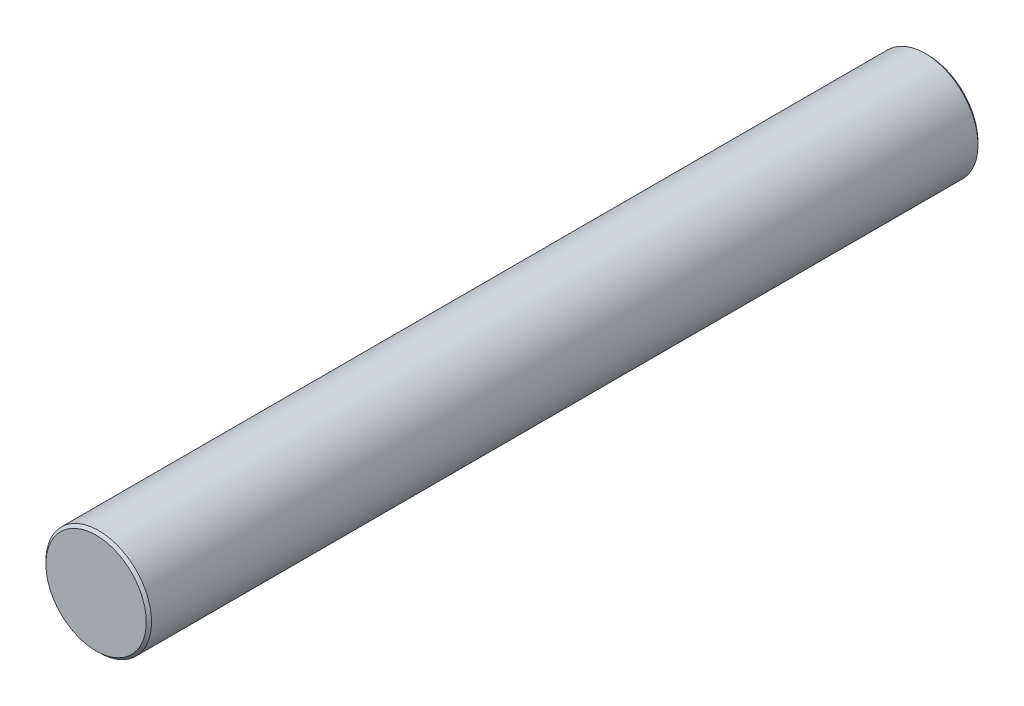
from build123d import *

# Parameters (mm, degrees)
SKETCH_1_R              = 40
EXTRUDE_1_DEPTH         = 630
HOLE_WIZARD_M16_1_D     = 14
HOLE_WIZARD_M16_1_DEPTH = 38
HOLE_WIZARD_M16_1_TIP   = 4.206024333
CHAMFER_1_SIZE          = 2


with BuildPart() as part:
    # Sketch 1 → Extrude 1 (new body)
    with BuildSketch(Plane.XY):
        Circle(SKETCH_1_R)
    extrude(amount=EXTRUDE_1_DEPTH)

    # Hole Wizard M16 _1
    with Locations(Plane(origin=(0, 0, 0), x_dir=(-1, 0, 0), z_dir=(0, 0, -1))):
        with Locations((0, 0)):
            Hole(HOLE_WIZARD_M16_1_D / 2, depth=HOLE_WIZARD_M16_1_DEPTH)
            with Locations((0, 0, -(HOLE_WIZARD_M16_1_DEPTH + HOLE_WIZARD_M16_1_TIP / 2))):  # 118° drill point
                Cone(0, HOLE_WIZARD_M16_1_D / 2, HOLE_WIZARD_M16_1_TIP, mode=Mode.SUBTRACT)

    # Chamfer 1
    chamfer_1_edges = [part.edges().sort_by_distance(p)[0] for p in [
        (-40, 0, 0),
        (-40, 0, 630),
    ]]
    chamfer(chamfer_1_edges, length=CHAMFER_1_SIZE)


solid = part.part
